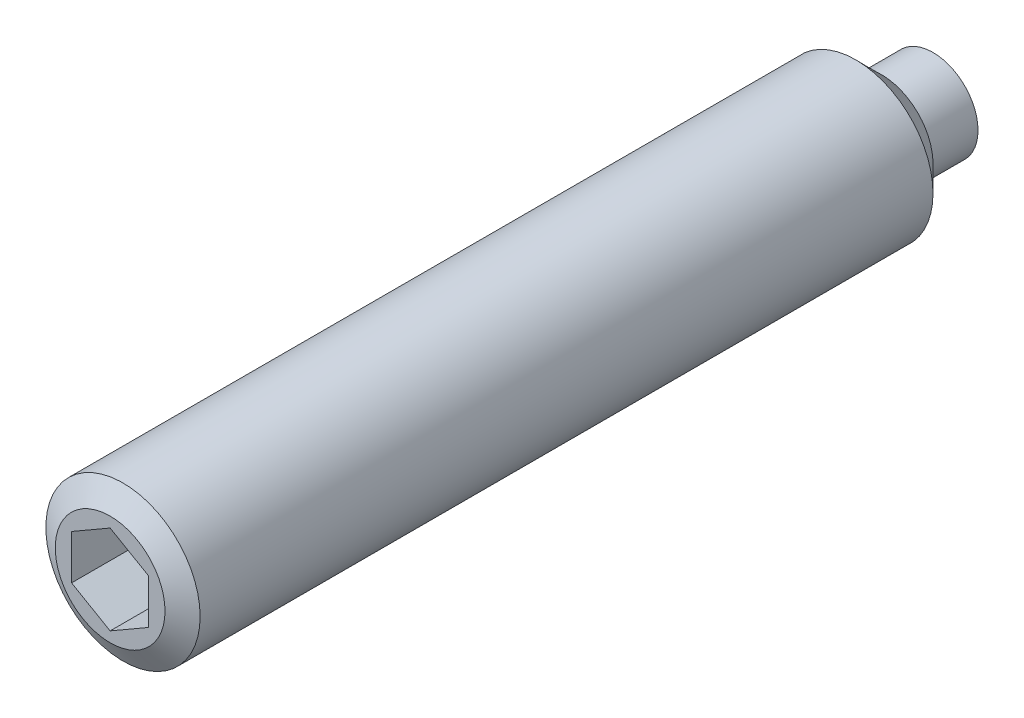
ISO-10303-21;
HEADER;
FILE_DESCRIPTION(('STEP AP214'),'2;1');
FILE_NAME('part.step','',(''),(''),'','','');
FILE_SCHEMA(('AUTOMOTIVE_DESIGN { 1 0 10303 214 1 1 1 1 }'));
ENDSEC;
DATA;
#1=APPLICATION_CONTEXT('core data for automotive mechanical design processes');
#2=APPLICATION_PROTOCOL_DEFINITION('international standard','automotive_design',2000,#1);
#3=PRODUCT_CONTEXT('',#1,'mechanical');
#4=PRODUCT('Part','Part','',(#3));
#5=PRODUCT_RELATED_PRODUCT_CATEGORY('part','',(#4));
#6=PRODUCT_DEFINITION_FORMATION('','',#4);
#7=PRODUCT_DEFINITION_CONTEXT('part definition',#1,'design');
#8=PRODUCT_DEFINITION('design','',#6,#7);
#9=PRODUCT_DEFINITION_SHAPE('','',#8);
#10=(LENGTH_UNIT() NAMED_UNIT(*) SI_UNIT(.MILLI.,.METRE.));
#11=(NAMED_UNIT(*) PLANE_ANGLE_UNIT() SI_UNIT($,.RADIAN.));
#12=(NAMED_UNIT(*) SI_UNIT($,.STERADIAN.) SOLID_ANGLE_UNIT());
#13=UNCERTAINTY_MEASURE_WITH_UNIT(LENGTH_MEASURE(1.E-05),#10,'distance_accuracy_value','');
#14=(GEOMETRIC_REPRESENTATION_CONTEXT(3) GLOBAL_UNCERTAINTY_ASSIGNED_CONTEXT((#13)) GLOBAL_UNIT_ASSIGNED_CONTEXT((#10,
#11,#12)) REPRESENTATION_CONTEXT('',''));
#15=CARTESIAN_POINT('',(0.,0.,0.));
#16=DIRECTION('',(0.,0.,1.));
#17=DIRECTION('',(1.,0.,0.));
#18=AXIS2_PLACEMENT_3D('',#15,#16,#17);
#19=CARTESIAN_POINT('',(1.75,0.,0.));
#20=DIRECTION('',(0.,0.,-1.));
#21=DIRECTION('',(-1.,0.,0.));
#22=AXIS2_PLACEMENT_3D('',#19,#20,#21);
#23=PLANE('',#22);
#24=CARTESIAN_POINT('',(0.,0.,0.));
#25=DIRECTION('',(0.,0.,1.));
#26=DIRECTION('',(1.,0.,0.));
#27=AXIS2_PLACEMENT_3D('',#24,#25,#26);
#28=CIRCLE('',#27,1.75);
#29=CARTESIAN_POINT('',(1.75,0.,0.));
#30=VERTEX_POINT('',#29);
#31=EDGE_CURVE('E124',#30,#30,#28,.T.);
#32=ORIENTED_EDGE('',*,*,#31,.F.);
#33=EDGE_LOOP('',(#32));
#34=FACE_BOUND('',#33,.T.);
#35=ADVANCED_FACE('F14',(#34),#23,.T.);
#36=CARTESIAN_POINT('',(0.,0.,52.));
#37=DIRECTION('',(0.,0.,1.));
#38=DIRECTION('',(1.,0.,0.));
#39=AXIS2_PLACEMENT_3D('',#36,#37,#38);
#40=CYLINDRICAL_SURFACE('',#39,1.75);
#41=CARTESIAN_POINT('',(0.,0.,2.));
#42=DIRECTION('',(0.,0.,1.));
#43=DIRECTION('',(1.,0.,0.));
#44=AXIS2_PLACEMENT_3D('',#41,#42,#43);
#45=CIRCLE('',#44,1.75);
#46=CARTESIAN_POINT('',(1.75,0.,2.));
#47=VERTEX_POINT('',#46);
#48=EDGE_CURVE('E121',#47,#47,#45,.T.);
#49=ORIENTED_EDGE('',*,*,#48,.F.);
#50=EDGE_LOOP('',(#49));
#51=FACE_BOUND('',#50,.T.);
#52=ORIENTED_EDGE('',*,*,#31,.T.);
#53=EDGE_LOOP('',(#52));
#54=FACE_BOUND('',#53,.T.);
#55=ADVANCED_FACE('F149',(#51,#54),#40,.T.);
#56=CARTESIAN_POINT('',(3.,0.,2.));
#57=DIRECTION('',(0.,0.,-1.));
#58=DIRECTION('',(-1.,0.,0.));
#59=AXIS2_PLACEMENT_3D('',#56,#57,#58);
#60=PLANE('',#59);
#61=CARTESIAN_POINT('',(0.,0.,2.));
#62=DIRECTION('',(0.,0.,-1.));
#63=DIRECTION('',(-1.,0.,0.));
#64=AXIS2_PLACEMENT_3D('',#61,#62,#63);
#65=CIRCLE('',#64,2.);
#66=CARTESIAN_POINT('',(-2.,0.,2.));
#67=VERTEX_POINT('',#66);
#68=EDGE_CURVE('E130',#67,#67,#65,.T.);
#69=ORIENTED_EDGE('',*,*,#68,.T.);
#70=EDGE_LOOP('',(#69));
#71=FACE_BOUND('',#70,.T.);
#72=ORIENTED_EDGE('',*,*,#48,.T.);
#73=EDGE_LOOP('',(#72));
#74=FACE_BOUND('',#73,.T.);
#75=ADVANCED_FACE('F155',(#71,#74),#60,.T.);
#76=CARTESIAN_POINT('',(0.,0.,52.));
#77=DIRECTION('',(0.,0.,1.));
#78=DIRECTION('',(1.,0.,0.));
#79=AXIS2_PLACEMENT_3D('',#76,#77,#78);
#80=CYLINDRICAL_SURFACE('',#79,3.);
#81=CARTESIAN_POINT('',(0.,0.,31.5));
#82=DIRECTION('',(0.,0.,1.));
#83=DIRECTION('',(1.,0.,0.));
#84=AXIS2_PLACEMENT_3D('',#81,#82,#83);
#85=CIRCLE('',#84,3.);
#86=CARTESIAN_POINT('',(3.,0.,31.5));
#87=VERTEX_POINT('',#86);
#88=EDGE_CURVE('E9',#87,#87,#85,.F.);
#89=ORIENTED_EDGE('',*,*,#88,.T.);
#90=EDGE_LOOP('',(#89));
#91=FACE_BOUND('',#90,.T.);
#92=CARTESIAN_POINT('',(0.,0.,3.));
#93=DIRECTION('',(0.,0.,-1.));
#94=DIRECTION('',(-1.,0.,0.));
#95=AXIS2_PLACEMENT_3D('',#92,#93,#94);
#96=CIRCLE('',#95,3.);
#97=CARTESIAN_POINT('',(-3.,0.,3.));
#98=VERTEX_POINT('',#97);
#99=EDGE_CURVE('E127',#98,#98,#96,.F.);
#100=ORIENTED_EDGE('',*,*,#99,.T.);
#101=EDGE_LOOP('',(#100));
#102=FACE_BOUND('',#101,.T.);
#103=ADVANCED_FACE('F162',(#91,#102),#80,.T.);
#104=CARTESIAN_POINT('',(0.,0.,32.));
#105=DIRECTION('',(0.,0.,1.));
#106=DIRECTION('',(1.,0.,0.));
#107=AXIS2_PLACEMENT_3D('',#104,#105,#106);
#108=PLANE('',#107);
#109=CARTESIAN_POINT('',(0.,0.,32.));
#110=DIRECTION('',(0.,0.,1.));
#111=DIRECTION('',(1.,0.,0.));
#112=AXIS2_PLACEMENT_3D('',#109,#110,#111);
#113=CIRCLE('',#112,2.13397459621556);
#114=CARTESIAN_POINT('',(2.13397459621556,0.,32.));
#115=VERTEX_POINT('',#114);
#116=EDGE_CURVE('E22',#115,#115,#113,.T.);
#117=ORIENTED_EDGE('',*,*,#116,.T.);
#118=EDGE_LOOP('',(#117));
#119=FACE_BOUND('',#118,.T.);
#120=DIRECTION('',(0.86602540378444,-0.5,0.));
#121=VECTOR('',#120,1.);
#122=CARTESIAN_POINT('',(-1.5,-0.866025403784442,32.));
#123=LINE('',#122,#121);
#124=CARTESIAN_POINT('',(-1.5,-0.866025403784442,32.));
#125=VERTEX_POINT('',#124);
#126=CARTESIAN_POINT('',(0.,-1.73205080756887,32.));
#127=VERTEX_POINT('',#126);
#128=EDGE_CURVE('E29',#125,#127,#123,.T.);
#129=ORIENTED_EDGE('',*,*,#128,.F.);
#130=DIRECTION('',(0.,-1.,0.));
#131=VECTOR('',#130,1.);
#132=CARTESIAN_POINT('',(-1.5,0.866025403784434,32.));
#133=LINE('',#132,#131);
#134=CARTESIAN_POINT('',(-1.5,0.866025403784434,32.));
#135=VERTEX_POINT('',#134);
#136=EDGE_CURVE('E97',#135,#125,#133,.T.);
#137=ORIENTED_EDGE('',*,*,#136,.F.);
#138=DIRECTION('',(0.866025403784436,0.5,0.));
#139=VECTOR('',#138,1.);
#140=CARTESIAN_POINT('',(-1.5,0.866025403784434,32.));
#141=LINE('',#140,#139);
#142=CARTESIAN_POINT('',(0.,1.73205080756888,32.));
#143=VERTEX_POINT('',#142);
#144=EDGE_CURVE('E92',#135,#143,#141,.T.);
#145=ORIENTED_EDGE('',*,*,#144,.T.);
#146=DIRECTION('',(-0.866025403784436,0.5,0.));
#147=VECTOR('',#146,1.);
#148=CARTESIAN_POINT('',(1.5,0.866025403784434,32.));
#149=LINE('',#148,#147);
#150=CARTESIAN_POINT('',(1.5,0.866025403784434,32.));
#151=VERTEX_POINT('',#150);
#152=EDGE_CURVE('E90',#151,#143,#149,.T.);
#153=ORIENTED_EDGE('',*,*,#152,.F.);
#154=DIRECTION('',(0.,-1.,0.));
#155=VECTOR('',#154,1.);
#156=CARTESIAN_POINT('',(1.5,0.866025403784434,32.));
#157=LINE('',#156,#155);
#158=CARTESIAN_POINT('',(1.5,-0.866025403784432,32.));
#159=VERTEX_POINT('',#158);
#160=EDGE_CURVE('E72',#151,#159,#157,.T.);
#161=ORIENTED_EDGE('',*,*,#160,.T.);
#162=DIRECTION('',(-0.866025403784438,-0.5,0.));
#163=VECTOR('',#162,1.);
#164=CARTESIAN_POINT('',(1.5,-0.866025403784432,32.));
#165=LINE('',#164,#163);
#166=EDGE_CURVE('E83',#159,#127,#165,.T.);
#167=ORIENTED_EDGE('',*,*,#166,.T.);
#168=EDGE_LOOP('',(#129,#137,#145,#153,#161,#167));
#169=FACE_BOUND('',#168,.T.);
#170=ADVANCED_FACE('F87',(#119,#169),#108,.T.);
#171=CARTESIAN_POINT('',(-1.5,-0.866025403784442,29.));
#172=DIRECTION('',(-0.5,-0.86602540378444,0.));
#173=DIRECTION('',(-0.86602540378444,0.5,0.));
#174=AXIS2_PLACEMENT_3D('',#171,#172,#173);
#175=PLANE('',#174);
#176=DIRECTION('',(0.,0.,1.));
#177=VECTOR('',#176,1.);
#178=CARTESIAN_POINT('',(-1.5,-0.866025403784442,29.));
#179=LINE('',#178,#177);
#180=CARTESIAN_POINT('',(-1.5,-0.866025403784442,29.));
#181=VERTEX_POINT('',#180);
#182=EDGE_CURVE('E36',#181,#125,#179,.T.);
#183=ORIENTED_EDGE('',*,*,#182,.T.);
#184=ORIENTED_EDGE('',*,*,#128,.T.);
#185=DIRECTION('',(0.,0.,1.));
#186=VECTOR('',#185,1.);
#187=CARTESIAN_POINT('',(0.,-1.73205080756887,29.));
#188=LINE('',#187,#186);
#189=CARTESIAN_POINT('',(0.,-1.73205080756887,29.));
#190=VERTEX_POINT('',#189);
#191=EDGE_CURVE('E80',#190,#127,#188,.T.);
#192=ORIENTED_EDGE('',*,*,#191,.F.);
#193=DIRECTION('',(0.86602540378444,-0.5,0.));
#194=VECTOR('',#193,1.);
#195=CARTESIAN_POINT('',(-1.5,-0.866025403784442,29.));
#196=LINE('',#195,#194);
#197=EDGE_CURVE('E99',#181,#190,#196,.T.);
#198=ORIENTED_EDGE('',*,*,#197,.F.);
#199=EDGE_LOOP('',(#183,#184,#192,#198));
#200=FACE_BOUND('',#199,.T.);
#201=ADVANCED_FACE('F169',(#200),#175,.F.);
#202=CARTESIAN_POINT('',(-1.5,0.866025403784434,29.));
#203=DIRECTION('',(-1.,0.,0.));
#204=DIRECTION('',(0.,1.,0.));
#205=AXIS2_PLACEMENT_3D('',#202,#203,#204);
#206=PLANE('',#205);
#207=DIRECTION('',(0.,0.,1.));
#208=VECTOR('',#207,1.);
#209=CARTESIAN_POINT('',(-1.5,0.866025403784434,29.));
#210=LINE('',#209,#208);
#211=CARTESIAN_POINT('',(-1.5,0.866025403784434,29.));
#212=VERTEX_POINT('',#211);
#213=EDGE_CURVE('E118',#212,#135,#210,.T.);
#214=ORIENTED_EDGE('',*,*,#213,.T.);
#215=ORIENTED_EDGE('',*,*,#136,.T.);
#216=ORIENTED_EDGE('',*,*,#182,.F.);
#217=DIRECTION('',(0.,-1.,0.));
#218=VECTOR('',#217,1.);
#219=CARTESIAN_POINT('',(-1.5,0.866025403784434,29.));
#220=LINE('',#219,#218);
#221=EDGE_CURVE('E111',#212,#181,#220,.T.);
#222=ORIENTED_EDGE('',*,*,#221,.F.);
#223=EDGE_LOOP('',(#214,#215,#216,#222));
#224=FACE_BOUND('',#223,.T.);
#225=ADVANCED_FACE('F170',(#224),#206,.F.);
#226=CARTESIAN_POINT('',(-1.5,0.866025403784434,29.));
#227=DIRECTION('',(0.5,-0.866025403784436,0.));
#228=DIRECTION('',(-0.866025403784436,-0.5,0.));
#229=AXIS2_PLACEMENT_3D('',#226,#227,#228);
#230=PLANE('',#229);
#231=DIRECTION('',(0.,0.,1.));
#232=VECTOR('',#231,1.);
#233=CARTESIAN_POINT('',(0.,1.73205080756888,29.));
#234=LINE('',#233,#232);
#235=CARTESIAN_POINT('',(0.,1.73205080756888,29.));
#236=VERTEX_POINT('',#235);
#237=EDGE_CURVE('E116',#236,#143,#234,.T.);
#238=ORIENTED_EDGE('',*,*,#237,.T.);
#239=ORIENTED_EDGE('',*,*,#144,.F.);
#240=ORIENTED_EDGE('',*,*,#213,.F.);
#241=DIRECTION('',(0.866025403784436,0.5,0.));
#242=VECTOR('',#241,1.);
#243=CARTESIAN_POINT('',(-1.5,0.866025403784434,29.));
#244=LINE('',#243,#242);
#245=EDGE_CURVE('E108',#212,#236,#244,.T.);
#246=ORIENTED_EDGE('',*,*,#245,.T.);
#247=EDGE_LOOP('',(#238,#239,#240,#246));
#248=FACE_BOUND('',#247,.T.);
#249=ADVANCED_FACE('F173',(#248),#230,.T.);
#250=CARTESIAN_POINT('',(1.5,0.866025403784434,29.));
#251=DIRECTION('',(0.5,0.866025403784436,0.));
#252=DIRECTION('',(0.866025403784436,-0.5,0.));
#253=AXIS2_PLACEMENT_3D('',#250,#251,#252);
#254=PLANE('',#253);
#255=DIRECTION('',(0.,0.,1.));
#256=VECTOR('',#255,1.);
#257=CARTESIAN_POINT('',(1.5,0.866025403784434,29.));
#258=LINE('',#257,#256);
#259=CARTESIAN_POINT('',(1.5,0.866025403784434,29.));
#260=VERTEX_POINT('',#259);
#261=EDGE_CURVE('E79',#260,#151,#258,.T.);
#262=ORIENTED_EDGE('',*,*,#261,.T.);
#263=ORIENTED_EDGE('',*,*,#152,.T.);
#264=ORIENTED_EDGE('',*,*,#237,.F.);
#265=DIRECTION('',(-0.866025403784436,0.5,0.));
#266=VECTOR('',#265,1.);
#267=CARTESIAN_POINT('',(1.5,0.866025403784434,29.));
#268=LINE('',#267,#266);
#269=EDGE_CURVE('E105',#260,#236,#268,.T.);
#270=ORIENTED_EDGE('',*,*,#269,.F.);
#271=EDGE_LOOP('',(#262,#263,#264,#270));
#272=FACE_BOUND('',#271,.T.);
#273=ADVANCED_FACE('F176',(#272),#254,.F.);
#274=CARTESIAN_POINT('',(1.5,0.866025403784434,29.));
#275=DIRECTION('',(-1.,0.,0.));
#276=DIRECTION('',(0.,1.,0.));
#277=AXIS2_PLACEMENT_3D('',#274,#275,#276);
#278=PLANE('',#277);
#279=DIRECTION('',(0.,0.,1.));
#280=VECTOR('',#279,1.);
#281=CARTESIAN_POINT('',(1.5,-0.866025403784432,29.));
#282=LINE('',#281,#280);
#283=CARTESIAN_POINT('',(1.5,-0.866025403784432,29.));
#284=VERTEX_POINT('',#283);
#285=EDGE_CURVE('E68',#284,#159,#282,.T.);
#286=ORIENTED_EDGE('',*,*,#285,.T.);
#287=ORIENTED_EDGE('',*,*,#160,.F.);
#288=ORIENTED_EDGE('',*,*,#261,.F.);
#289=DIRECTION('',(0.,-1.,0.));
#290=VECTOR('',#289,1.);
#291=CARTESIAN_POINT('',(1.5,0.866025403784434,29.));
#292=LINE('',#291,#290);
#293=EDGE_CURVE('E75',#260,#284,#292,.T.);
#294=ORIENTED_EDGE('',*,*,#293,.T.);
#295=EDGE_LOOP('',(#286,#287,#288,#294));
#296=FACE_BOUND('',#295,.T.);
#297=ADVANCED_FACE('F70',(#296),#278,.T.);
#298=CARTESIAN_POINT('',(1.5,-0.866025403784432,29.));
#299=DIRECTION('',(-0.5,0.866025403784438,0.));
#300=DIRECTION('',(0.866025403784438,0.5,0.));
#301=AXIS2_PLACEMENT_3D('',#298,#299,#300);
#302=PLANE('',#301);
#303=DIRECTION('',(-0.866025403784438,-0.5,0.));
#304=VECTOR('',#303,1.);
#305=CARTESIAN_POINT('',(1.5,-0.866025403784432,29.));
#306=LINE('',#305,#304);
#307=EDGE_CURVE('E102',#284,#190,#306,.T.);
#308=ORIENTED_EDGE('',*,*,#307,.T.);
#309=ORIENTED_EDGE('',*,*,#191,.T.);
#310=ORIENTED_EDGE('',*,*,#166,.F.);
#311=ORIENTED_EDGE('',*,*,#285,.F.);
#312=EDGE_LOOP('',(#308,#309,#310,#311));
#313=FACE_BOUND('',#312,.T.);
#314=ADVANCED_FACE('F84',(#313),#302,.T.);
#315=CARTESIAN_POINT('',(-1.5,-0.866025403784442,29.));
#316=DIRECTION('',(0.,0.,-1.));
#317=DIRECTION('',(-1.,0.,0.));
#318=AXIS2_PLACEMENT_3D('',#315,#316,#317);
#319=PLANE('',#318);
#320=ORIENTED_EDGE('',*,*,#197,.T.);
#321=ORIENTED_EDGE('',*,*,#307,.F.);
#322=ORIENTED_EDGE('',*,*,#293,.F.);
#323=ORIENTED_EDGE('',*,*,#269,.T.);
#324=ORIENTED_EDGE('',*,*,#245,.F.);
#325=ORIENTED_EDGE('',*,*,#221,.T.);
#326=EDGE_LOOP('',(#320,#321,#322,#323,#324,#325));
#327=FACE_BOUND('',#326,.T.);
#328=ADVANCED_FACE('F144',(#327),#319,.F.);
#329=CARTESIAN_POINT('',(0.,0.,3.));
#330=DIRECTION('',(0.,0.,1.));
#331=DIRECTION('',(1.,0.,0.));
#332=AXIS2_PLACEMENT_3D('',#329,#330,#331);
#333=CONICAL_SURFACE('',#332,3.,0.785398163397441);
#334=ORIENTED_EDGE('',*,*,#68,.F.);
#335=EDGE_LOOP('',(#334));
#336=FACE_BOUND('',#335,.T.);
#337=ORIENTED_EDGE('',*,*,#99,.F.);
#338=EDGE_LOOP('',(#337));
#339=FACE_BOUND('',#338,.T.);
#340=ADVANCED_FACE('F137',(#336,#339),#333,.T.);
#341=CARTESIAN_POINT('',(0.,0.,32.));
#342=DIRECTION('',(0.,0.,-1.));
#343=DIRECTION('',(-1.,0.,0.));
#344=AXIS2_PLACEMENT_3D('',#341,#342,#343);
#345=CONICAL_SURFACE('',#344,2.13397459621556,1.0471975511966);
#346=ORIENTED_EDGE('',*,*,#88,.F.);
#347=EDGE_LOOP('',(#346));
#348=FACE_BOUND('',#347,.T.);
#349=ORIENTED_EDGE('',*,*,#116,.F.);
#350=EDGE_LOOP('',(#349));
#351=FACE_BOUND('',#350,.T.);
#352=ADVANCED_FACE('F16',(#348,#351),#345,.T.);
#353=CLOSED_SHELL('',(#35,#55,#75,#103,#170,#201,#225,#249,#273,#297,#314,#328,#340,#352));
#354=MANIFOLD_SOLID_BREP('B1',#353);
#355=ADVANCED_BREP_SHAPE_REPRESENTATION('',(#18,#354),#14);
#356=SHAPE_DEFINITION_REPRESENTATION(#9,#355);
ENDSEC;
END-ISO-10303-21;
